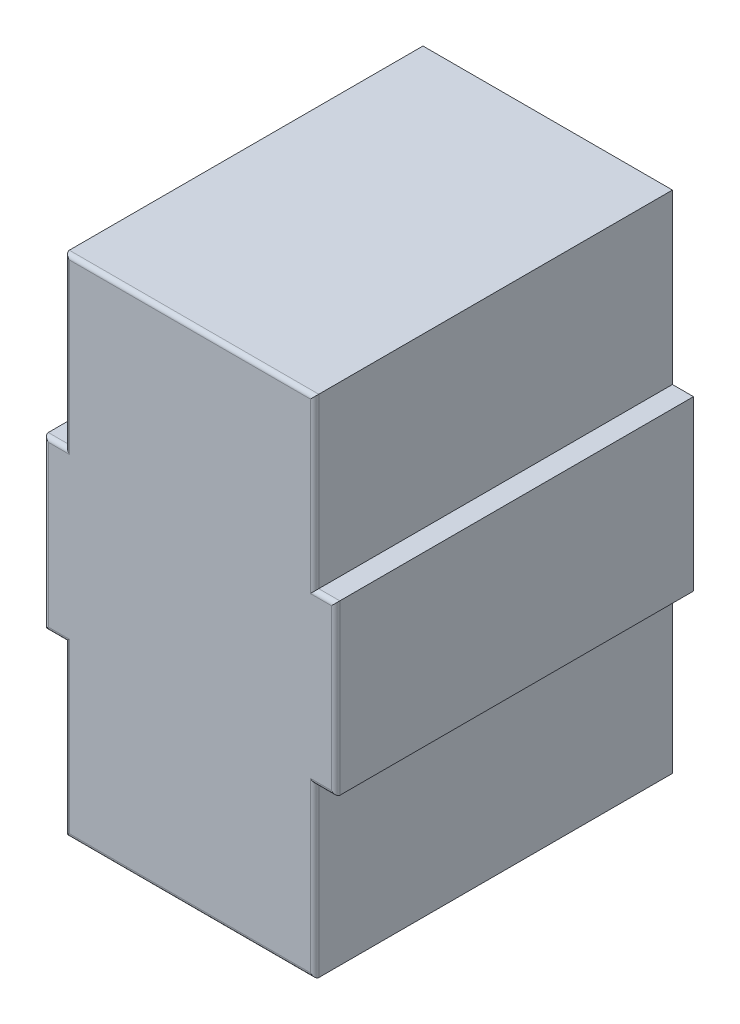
ISO-10303-21;
HEADER;
FILE_DESCRIPTION(('STEP AP214'),'2;1');
FILE_NAME('part.step','',(''),(''),'','','');
FILE_SCHEMA(('AUTOMOTIVE_DESIGN { 1 0 10303 214 1 1 1 1 }'));
ENDSEC;
DATA;
#1=APPLICATION_CONTEXT('core data for automotive mechanical design processes');
#2=APPLICATION_PROTOCOL_DEFINITION('international standard','automotive_design',2000,#1);
#3=PRODUCT_CONTEXT('',#1,'mechanical');
#4=PRODUCT('Part','Part','',(#3));
#5=PRODUCT_RELATED_PRODUCT_CATEGORY('part','',(#4));
#6=PRODUCT_DEFINITION_FORMATION('','',#4);
#7=PRODUCT_DEFINITION_CONTEXT('part definition',#1,'design');
#8=PRODUCT_DEFINITION('design','',#6,#7);
#9=PRODUCT_DEFINITION_SHAPE('','',#8);
#10=(LENGTH_UNIT() NAMED_UNIT(*) SI_UNIT(.MILLI.,.METRE.));
#11=(NAMED_UNIT(*) PLANE_ANGLE_UNIT() SI_UNIT($,.RADIAN.));
#12=(NAMED_UNIT(*) SI_UNIT($,.STERADIAN.) SOLID_ANGLE_UNIT());
#13=UNCERTAINTY_MEASURE_WITH_UNIT(LENGTH_MEASURE(1.E-05),#10,'distance_accuracy_value','');
#14=(GEOMETRIC_REPRESENTATION_CONTEXT(3) GLOBAL_UNCERTAINTY_ASSIGNED_CONTEXT((#13)) GLOBAL_UNIT_ASSIGNED_CONTEXT((#10,
#11,#12)) REPRESENTATION_CONTEXT('',''));
#15=CARTESIAN_POINT('',(0.,0.,0.));
#16=DIRECTION('',(0.,0.,1.));
#17=DIRECTION('',(1.,0.,0.));
#18=AXIS2_PLACEMENT_3D('',#15,#16,#17);
#19=CARTESIAN_POINT('',(1.,0.,17.));
#20=DIRECTION('',(0.,1.,0.));
#21=DIRECTION('',(0.,0.,1.));
#22=AXIS2_PLACEMENT_3D('',#19,#20,#21);
#23=PLANE('',#22);
#24=DIRECTION('',(0.,0.,-1.));
#25=VECTOR('',#24,1.);
#26=CARTESIAN_POINT('',(12.85,0.,17.));
#27=LINE('',#26,#25);
#28=CARTESIAN_POINT('',(12.85,0.,16.8));
#29=VERTEX_POINT('',#28);
#30=CARTESIAN_POINT('',(12.85,0.,0.));
#31=VERTEX_POINT('',#30);
#32=EDGE_CURVE('E153',#29,#31,#27,.T.);
#33=ORIENTED_EDGE('',*,*,#32,.F.);
#34=DIRECTION('',(1.,0.,0.));
#35=VECTOR('',#34,1.);
#36=CARTESIAN_POINT('',(1.,0.,16.8));
#37=LINE('',#36,#35);
#38=CARTESIAN_POINT('',(1.,0.,16.8));
#39=VERTEX_POINT('',#38);
#40=EDGE_CURVE('E11',#29,#39,#37,.F.);
#41=ORIENTED_EDGE('',*,*,#40,.T.);
#42=DIRECTION('',(0.,0.,-1.));
#43=VECTOR('',#42,1.);
#44=CARTESIAN_POINT('',(1.,0.,17.));
#45=LINE('',#44,#43);
#46=CARTESIAN_POINT('',(1.,0.,0.));
#47=VERTEX_POINT('',#46);
#48=EDGE_CURVE('E174',#39,#47,#45,.T.);
#49=ORIENTED_EDGE('',*,*,#48,.T.);
#50=DIRECTION('',(1.,0.,0.));
#51=VECTOR('',#50,1.);
#52=CARTESIAN_POINT('',(1.,0.,0.));
#53=LINE('',#52,#51);
#54=EDGE_CURVE('E168',#47,#31,#53,.T.);
#55=ORIENTED_EDGE('',*,*,#54,.T.);
#56=EDGE_LOOP('',(#33,#41,#49,#55));
#57=FACE_BOUND('',#56,.T.);
#58=ADVANCED_FACE('F32',(#57),#23,.F.);
#59=CARTESIAN_POINT('',(12.85,0.,17.));
#60=DIRECTION('',(-1.,0.,0.));
#61=DIRECTION('',(0.,0.,1.));
#62=AXIS2_PLACEMENT_3D('',#59,#60,#61);
#63=PLANE('',#62);
#64=DIRECTION('',(0.,0.,-1.));
#65=VECTOR('',#64,1.);
#66=CARTESIAN_POINT('',(12.85,8.,17.));
#67=LINE('',#66,#65);
#68=CARTESIAN_POINT('',(12.85,8.,16.8));
#69=VERTEX_POINT('',#68);
#70=CARTESIAN_POINT('',(12.85,8.,0.));
#71=VERTEX_POINT('',#70);
#72=EDGE_CURVE('E162',#69,#71,#67,.T.);
#73=ORIENTED_EDGE('',*,*,#72,.F.);
#74=DIRECTION('',(0.,1.,0.));
#75=VECTOR('',#74,1.);
#76=CARTESIAN_POINT('',(12.85,0.,16.8));
#77=LINE('',#76,#75);
#78=EDGE_CURVE('E39',#69,#29,#77,.F.);
#79=ORIENTED_EDGE('',*,*,#78,.T.);
#80=ORIENTED_EDGE('',*,*,#32,.T.);
#81=DIRECTION('',(0.,1.,0.));
#82=VECTOR('',#81,1.);
#83=CARTESIAN_POINT('',(12.85,0.,0.));
#84=LINE('',#83,#82);
#85=EDGE_CURVE('E156',#31,#71,#84,.T.);
#86=ORIENTED_EDGE('',*,*,#85,.T.);
#87=EDGE_LOOP('',(#73,#79,#80,#86));
#88=FACE_BOUND('',#87,.T.);
#89=ADVANCED_FACE('F155',(#88),#63,.F.);
#90=CARTESIAN_POINT('',(13.85,8.,17.));
#91=DIRECTION('',(0.,1.,0.));
#92=DIRECTION('',(0.,0.,1.));
#93=AXIS2_PLACEMENT_3D('',#90,#91,#92);
#94=PLANE('',#93);
#95=DIRECTION('',(0.,0.,-1.));
#96=VECTOR('',#95,1.);
#97=CARTESIAN_POINT('',(13.85,8.,17.));
#98=LINE('',#97,#96);
#99=CARTESIAN_POINT('',(13.85,8.,16.8));
#100=VERTEX_POINT('',#99);
#101=CARTESIAN_POINT('',(13.85,8.,0.));
#102=VERTEX_POINT('',#101);
#103=EDGE_CURVE('E227',#100,#102,#98,.T.);
#104=ORIENTED_EDGE('',*,*,#103,.F.);
#105=DIRECTION('',(1.,0.,0.));
#106=VECTOR('',#105,1.);
#107=CARTESIAN_POINT('',(12.85,8.,16.8));
#108=LINE('',#107,#106);
#109=EDGE_CURVE('E53',#100,#69,#108,.F.);
#110=ORIENTED_EDGE('',*,*,#109,.T.);
#111=ORIENTED_EDGE('',*,*,#72,.T.);
#112=DIRECTION('',(1.,0.,0.));
#113=VECTOR('',#112,1.);
#114=CARTESIAN_POINT('',(13.85,8.,0.));
#115=LINE('',#114,#113);
#116=EDGE_CURVE('E171',#71,#102,#115,.T.);
#117=ORIENTED_EDGE('',*,*,#116,.T.);
#118=EDGE_LOOP('',(#104,#110,#111,#117));
#119=FACE_BOUND('',#118,.T.);
#120=ADVANCED_FACE('F281',(#119),#94,.F.);
#121=CARTESIAN_POINT('',(13.85,8.,17.));
#122=DIRECTION('',(-1.,0.,0.));
#123=DIRECTION('',(0.,0.,1.));
#124=AXIS2_PLACEMENT_3D('',#121,#122,#123);
#125=PLANE('',#124);
#126=DIRECTION('',(0.,0.,-1.));
#127=VECTOR('',#126,1.);
#128=CARTESIAN_POINT('',(13.85,16.,17.));
#129=LINE('',#128,#127);
#130=CARTESIAN_POINT('',(13.85,16.,16.8));
#131=VERTEX_POINT('',#130);
#132=CARTESIAN_POINT('',(13.85,16.,0.));
#133=VERTEX_POINT('',#132);
#134=EDGE_CURVE('E225',#131,#133,#129,.T.);
#135=ORIENTED_EDGE('',*,*,#134,.F.);
#136=DIRECTION('',(0.,1.,0.));
#137=VECTOR('',#136,1.);
#138=CARTESIAN_POINT('',(13.85,8.,16.8));
#139=LINE('',#138,#137);
#140=EDGE_CURVE('E271',#131,#100,#139,.F.);
#141=ORIENTED_EDGE('',*,*,#140,.T.);
#142=ORIENTED_EDGE('',*,*,#103,.T.);
#143=DIRECTION('',(0.,1.,0.));
#144=VECTOR('',#143,1.);
#145=CARTESIAN_POINT('',(13.85,8.,0.));
#146=LINE('',#145,#144);
#147=EDGE_CURVE('E184',#102,#133,#146,.T.);
#148=ORIENTED_EDGE('',*,*,#147,.T.);
#149=EDGE_LOOP('',(#135,#141,#142,#148));
#150=FACE_BOUND('',#149,.T.);
#151=ADVANCED_FACE('F276',(#150),#125,.F.);
#152=CARTESIAN_POINT('',(13.85,16.,17.));
#153=DIRECTION('',(0.,-1.,0.));
#154=DIRECTION('',(0.,0.,-1.));
#155=AXIS2_PLACEMENT_3D('',#152,#153,#154);
#156=PLANE('',#155);
#157=DIRECTION('',(0.,0.,-1.));
#158=VECTOR('',#157,1.);
#159=CARTESIAN_POINT('',(12.85,16.,17.));
#160=LINE('',#159,#158);
#161=CARTESIAN_POINT('',(12.85,16.,16.8));
#162=VERTEX_POINT('',#161);
#163=CARTESIAN_POINT('',(12.85,16.,0.));
#164=VERTEX_POINT('',#163);
#165=EDGE_CURVE('E223',#162,#164,#160,.T.);
#166=ORIENTED_EDGE('',*,*,#165,.F.);
#167=DIRECTION('',(-1.,0.,0.));
#168=VECTOR('',#167,1.);
#169=CARTESIAN_POINT('',(13.85,16.,16.8));
#170=LINE('',#169,#168);
#171=EDGE_CURVE('E269',#162,#131,#170,.F.);
#172=ORIENTED_EDGE('',*,*,#171,.T.);
#173=ORIENTED_EDGE('',*,*,#134,.T.);
#174=DIRECTION('',(-1.,0.,0.));
#175=VECTOR('',#174,1.);
#176=CARTESIAN_POINT('',(13.85,16.,0.));
#177=LINE('',#176,#175);
#178=EDGE_CURVE('E187',#133,#164,#177,.T.);
#179=ORIENTED_EDGE('',*,*,#178,.T.);
#180=EDGE_LOOP('',(#166,#172,#173,#179));
#181=FACE_BOUND('',#180,.T.);
#182=ADVANCED_FACE('F403',(#181),#156,.F.);
#183=CARTESIAN_POINT('',(12.85,16.,17.));
#184=DIRECTION('',(-1.,0.,0.));
#185=DIRECTION('',(0.,0.,1.));
#186=AXIS2_PLACEMENT_3D('',#183,#184,#185);
#187=PLANE('',#186);
#188=DIRECTION('',(0.,0.,-1.));
#189=VECTOR('',#188,1.);
#190=CARTESIAN_POINT('',(12.85,24.,17.));
#191=LINE('',#190,#189);
#192=CARTESIAN_POINT('',(12.85,24.,16.8));
#193=VERTEX_POINT('',#192);
#194=CARTESIAN_POINT('',(12.85,24.,0.));
#195=VERTEX_POINT('',#194);
#196=EDGE_CURVE('E221',#193,#195,#191,.T.);
#197=ORIENTED_EDGE('',*,*,#196,.F.);
#198=DIRECTION('',(0.,1.,0.));
#199=VECTOR('',#198,1.);
#200=CARTESIAN_POINT('',(12.85,16.,16.8));
#201=LINE('',#200,#199);
#202=EDGE_CURVE('E267',#193,#162,#201,.F.);
#203=ORIENTED_EDGE('',*,*,#202,.T.);
#204=ORIENTED_EDGE('',*,*,#165,.T.);
#205=DIRECTION('',(0.,1.,0.));
#206=VECTOR('',#205,1.);
#207=CARTESIAN_POINT('',(12.85,16.,0.));
#208=LINE('',#207,#206);
#209=EDGE_CURVE('E190',#164,#195,#208,.T.);
#210=ORIENTED_EDGE('',*,*,#209,.T.);
#211=EDGE_LOOP('',(#197,#203,#204,#210));
#212=FACE_BOUND('',#211,.T.);
#213=ADVANCED_FACE('F406',(#212),#187,.F.);
#214=CARTESIAN_POINT('',(1.,24.,17.));
#215=DIRECTION('',(0.,-1.,0.));
#216=DIRECTION('',(0.,0.,-1.));
#217=AXIS2_PLACEMENT_3D('',#214,#215,#216);
#218=PLANE('',#217);
#219=DIRECTION('',(0.,0.,-1.));
#220=VECTOR('',#219,1.);
#221=CARTESIAN_POINT('',(1.,24.,17.));
#222=LINE('',#221,#220);
#223=CARTESIAN_POINT('',(1.,24.,16.8));
#224=VERTEX_POINT('',#223);
#225=CARTESIAN_POINT('',(1.,24.,0.));
#226=VERTEX_POINT('',#225);
#227=EDGE_CURVE('E219',#224,#226,#222,.T.);
#228=ORIENTED_EDGE('',*,*,#227,.F.);
#229=DIRECTION('',(-1.,0.,0.));
#230=VECTOR('',#229,1.);
#231=CARTESIAN_POINT('',(12.85,24.,16.8));
#232=LINE('',#231,#230);
#233=EDGE_CURVE('E265',#224,#193,#232,.F.);
#234=ORIENTED_EDGE('',*,*,#233,.T.);
#235=ORIENTED_EDGE('',*,*,#196,.T.);
#236=DIRECTION('',(-1.,0.,0.));
#237=VECTOR('',#236,1.);
#238=CARTESIAN_POINT('',(1.,24.,0.));
#239=LINE('',#238,#237);
#240=EDGE_CURVE('E193',#195,#226,#239,.T.);
#241=ORIENTED_EDGE('',*,*,#240,.T.);
#242=EDGE_LOOP('',(#228,#234,#235,#241));
#243=FACE_BOUND('',#242,.T.);
#244=ADVANCED_FACE('F378',(#243),#218,.F.);
#245=CARTESIAN_POINT('',(1.,16.,17.));
#246=DIRECTION('',(1.,0.,0.));
#247=DIRECTION('',(0.,1.,0.));
#248=AXIS2_PLACEMENT_3D('',#245,#246,#247);
#249=PLANE('',#248);
#250=DIRECTION('',(0.,0.,-1.));
#251=VECTOR('',#250,1.);
#252=CARTESIAN_POINT('',(1.,16.,17.));
#253=LINE('',#252,#251);
#254=CARTESIAN_POINT('',(1.,16.,16.8));
#255=VERTEX_POINT('',#254);
#256=CARTESIAN_POINT('',(1.,16.,0.));
#257=VERTEX_POINT('',#256);
#258=EDGE_CURVE('E217',#255,#257,#253,.T.);
#259=ORIENTED_EDGE('',*,*,#258,.F.);
#260=DIRECTION('',(0.,-1.,0.));
#261=VECTOR('',#260,1.);
#262=CARTESIAN_POINT('',(1.,24.,16.8));
#263=LINE('',#262,#261);
#264=EDGE_CURVE('E263',#255,#224,#263,.F.);
#265=ORIENTED_EDGE('',*,*,#264,.T.);
#266=ORIENTED_EDGE('',*,*,#227,.T.);
#267=DIRECTION('',(0.,-1.,0.));
#268=VECTOR('',#267,1.);
#269=CARTESIAN_POINT('',(1.,16.,0.));
#270=LINE('',#269,#268);
#271=EDGE_CURVE('E196',#226,#257,#270,.T.);
#272=ORIENTED_EDGE('',*,*,#271,.T.);
#273=EDGE_LOOP('',(#259,#265,#266,#272));
#274=FACE_BOUND('',#273,.T.);
#275=ADVANCED_FACE('F375',(#274),#249,.F.);
#276=CARTESIAN_POINT('',(1.,16.,17.));
#277=DIRECTION('',(0.,-1.,0.));
#278=DIRECTION('',(0.,0.,-1.));
#279=AXIS2_PLACEMENT_3D('',#276,#277,#278);
#280=PLANE('',#279);
#281=DIRECTION('',(0.,0.,-1.));
#282=VECTOR('',#281,1.);
#283=CARTESIAN_POINT('',(0.,16.,17.));
#284=LINE('',#283,#282);
#285=CARTESIAN_POINT('',(0.,16.,16.8));
#286=VERTEX_POINT('',#285);
#287=CARTESIAN_POINT('',(0.,16.,0.));
#288=VERTEX_POINT('',#287);
#289=EDGE_CURVE('E215',#286,#288,#284,.T.);
#290=ORIENTED_EDGE('',*,*,#289,.F.);
#291=DIRECTION('',(-1.,0.,0.));
#292=VECTOR('',#291,1.);
#293=CARTESIAN_POINT('',(0.999999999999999,16.,16.8));
#294=LINE('',#293,#292);
#295=EDGE_CURVE('E261',#286,#255,#294,.F.);
#296=ORIENTED_EDGE('',*,*,#295,.T.);
#297=ORIENTED_EDGE('',*,*,#258,.T.);
#298=DIRECTION('',(-1.,0.,0.));
#299=VECTOR('',#298,1.);
#300=CARTESIAN_POINT('',(1.,16.,0.));
#301=LINE('',#300,#299);
#302=EDGE_CURVE('E199',#257,#288,#301,.T.);
#303=ORIENTED_EDGE('',*,*,#302,.T.);
#304=EDGE_LOOP('',(#290,#296,#297,#303));
#305=FACE_BOUND('',#304,.T.);
#306=ADVANCED_FACE('F415',(#305),#280,.F.);
#307=CARTESIAN_POINT('',(0.,8.,17.));
#308=DIRECTION('',(1.,0.,0.));
#309=DIRECTION('',(0.,0.,-1.));
#310=AXIS2_PLACEMENT_3D('',#307,#308,#309);
#311=PLANE('',#310);
#312=DIRECTION('',(0.,0.,-1.));
#313=VECTOR('',#312,1.);
#314=CARTESIAN_POINT('',(0.,8.,17.));
#315=LINE('',#314,#313);
#316=CARTESIAN_POINT('',(0.,8.,16.8));
#317=VERTEX_POINT('',#316);
#318=CARTESIAN_POINT('',(0.,8.,0.));
#319=VERTEX_POINT('',#318);
#320=EDGE_CURVE('E213',#317,#319,#315,.T.);
#321=ORIENTED_EDGE('',*,*,#320,.F.);
#322=DIRECTION('',(0.,-1.,0.));
#323=VECTOR('',#322,1.);
#324=CARTESIAN_POINT('',(0.,16.,16.8));
#325=LINE('',#324,#323);
#326=EDGE_CURVE('E259',#317,#286,#325,.F.);
#327=ORIENTED_EDGE('',*,*,#326,.T.);
#328=ORIENTED_EDGE('',*,*,#289,.T.);
#329=DIRECTION('',(0.,-1.,0.));
#330=VECTOR('',#329,1.);
#331=CARTESIAN_POINT('',(0.,8.,0.));
#332=LINE('',#331,#330);
#333=EDGE_CURVE('E202',#288,#319,#332,.T.);
#334=ORIENTED_EDGE('',*,*,#333,.T.);
#335=EDGE_LOOP('',(#321,#327,#328,#334));
#336=FACE_BOUND('',#335,.T.);
#337=ADVANCED_FACE('F330',(#336),#311,.F.);
#338=CARTESIAN_POINT('',(1.,8.,17.));
#339=DIRECTION('',(0.,1.,0.));
#340=DIRECTION('',(0.,0.,1.));
#341=AXIS2_PLACEMENT_3D('',#338,#339,#340);
#342=PLANE('',#341);
#343=DIRECTION('',(0.,0.,-1.));
#344=VECTOR('',#343,1.);
#345=CARTESIAN_POINT('',(1.,8.,17.));
#346=LINE('',#345,#344);
#347=CARTESIAN_POINT('',(1.,8.,16.8));
#348=VERTEX_POINT('',#347);
#349=CARTESIAN_POINT('',(1.,8.,0.));
#350=VERTEX_POINT('',#349);
#351=EDGE_CURVE('E211',#348,#350,#346,.T.);
#352=ORIENTED_EDGE('',*,*,#351,.F.);
#353=DIRECTION('',(1.,0.,0.));
#354=VECTOR('',#353,1.);
#355=CARTESIAN_POINT('',(0.,8.,16.8));
#356=LINE('',#355,#354);
#357=EDGE_CURVE('E257',#348,#317,#356,.F.);
#358=ORIENTED_EDGE('',*,*,#357,.T.);
#359=ORIENTED_EDGE('',*,*,#320,.T.);
#360=DIRECTION('',(1.,0.,0.));
#361=VECTOR('',#360,1.);
#362=CARTESIAN_POINT('',(1.,8.,0.));
#363=LINE('',#362,#361);
#364=EDGE_CURVE('E205',#319,#350,#363,.T.);
#365=ORIENTED_EDGE('',*,*,#364,.T.);
#366=EDGE_LOOP('',(#352,#358,#359,#365));
#367=FACE_BOUND('',#366,.T.);
#368=ADVANCED_FACE('F327',(#367),#342,.F.);
#369=CARTESIAN_POINT('',(1.,0.,17.));
#370=DIRECTION('',(1.,0.,0.));
#371=DIRECTION('',(0.,1.,0.));
#372=AXIS2_PLACEMENT_3D('',#369,#370,#371);
#373=PLANE('',#372);
#374=ORIENTED_EDGE('',*,*,#48,.F.);
#375=DIRECTION('',(0.,-1.,0.));
#376=VECTOR('',#375,1.);
#377=CARTESIAN_POINT('',(1.,8.,16.8));
#378=LINE('',#377,#376);
#379=EDGE_CURVE('E254',#39,#348,#378,.F.);
#380=ORIENTED_EDGE('',*,*,#379,.T.);
#381=ORIENTED_EDGE('',*,*,#351,.T.);
#382=DIRECTION('',(0.,-1.,0.));
#383=VECTOR('',#382,1.);
#384=CARTESIAN_POINT('',(1.,0.,0.));
#385=LINE('',#384,#383);
#386=EDGE_CURVE('E208',#350,#47,#385,.T.);
#387=ORIENTED_EDGE('',*,*,#386,.T.);
#388=EDGE_LOOP('',(#374,#380,#381,#387));
#389=FACE_BOUND('',#388,.T.);
#390=ADVANCED_FACE('F312',(#389),#373,.F.);
#391=CARTESIAN_POINT('',(12.85,0.,17.));
#392=DIRECTION('',(0.,0.,1.));
#393=DIRECTION('',(1.,0.,0.));
#394=AXIS2_PLACEMENT_3D('',#391,#392,#393);
#395=PLANE('',#394);
#396=DIRECTION('',(1.,0.,0.));
#397=VECTOR('',#396,1.);
#398=CARTESIAN_POINT('',(0.999999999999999,8.2,17.));
#399=LINE('',#398,#397);
#400=CARTESIAN_POINT('',(0.200000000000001,8.2,17.));
#401=VERTEX_POINT('',#400);
#402=CARTESIAN_POINT('',(1.2,8.2,17.));
#403=VERTEX_POINT('',#402);
#404=EDGE_CURVE('E249',#401,#403,#399,.T.);
#405=ORIENTED_EDGE('',*,*,#404,.T.);
#406=DIRECTION('',(0.,-1.,0.));
#407=VECTOR('',#406,1.);
#408=CARTESIAN_POINT('',(1.2,0.,17.));
#409=LINE('',#408,#407);
#410=CARTESIAN_POINT('',(1.2,0.2,17.));
#411=VERTEX_POINT('',#410);
#412=EDGE_CURVE('E251',#403,#411,#409,.T.);
#413=ORIENTED_EDGE('',*,*,#412,.T.);
#414=DIRECTION('',(1.,0.,0.));
#415=VECTOR('',#414,1.);
#416=CARTESIAN_POINT('',(12.85,0.2,17.));
#417=LINE('',#416,#415);
#418=CARTESIAN_POINT('',(12.65,0.2,17.));
#419=VERTEX_POINT('',#418);
#420=EDGE_CURVE('E161',#411,#419,#417,.T.);
#421=ORIENTED_EDGE('',*,*,#420,.T.);
#422=DIRECTION('',(0.,1.,0.));
#423=VECTOR('',#422,1.);
#424=CARTESIAN_POINT('',(12.65,8.,17.));
#425=LINE('',#424,#423);
#426=CARTESIAN_POINT('',(12.65,8.2,17.));
#427=VERTEX_POINT('',#426);
#428=EDGE_CURVE('E231',#419,#427,#425,.T.);
#429=ORIENTED_EDGE('',*,*,#428,.T.);
#430=DIRECTION('',(1.,0.,0.));
#431=VECTOR('',#430,1.);
#432=CARTESIAN_POINT('',(13.85,8.2,17.));
#433=LINE('',#432,#431);
#434=CARTESIAN_POINT('',(13.65,8.2,17.));
#435=VERTEX_POINT('',#434);
#436=EDGE_CURVE('E233',#427,#435,#433,.T.);
#437=ORIENTED_EDGE('',*,*,#436,.T.);
#438=DIRECTION('',(0.,1.,0.));
#439=VECTOR('',#438,1.);
#440=CARTESIAN_POINT('',(13.65,16.,17.));
#441=LINE('',#440,#439);
#442=CARTESIAN_POINT('',(13.65,15.8,17.));
#443=VERTEX_POINT('',#442);
#444=EDGE_CURVE('E235',#435,#443,#441,.T.);
#445=ORIENTED_EDGE('',*,*,#444,.T.);
#446=DIRECTION('',(-1.,0.,0.));
#447=VECTOR('',#446,1.);
#448=CARTESIAN_POINT('',(12.85,15.8,17.));
#449=LINE('',#448,#447);
#450=CARTESIAN_POINT('',(12.65,15.8,17.));
#451=VERTEX_POINT('',#450);
#452=EDGE_CURVE('E237',#443,#451,#449,.T.);
#453=ORIENTED_EDGE('',*,*,#452,.T.);
#454=DIRECTION('',(0.,1.,0.));
#455=VECTOR('',#454,1.);
#456=CARTESIAN_POINT('',(12.65,24.,17.));
#457=LINE('',#456,#455);
#458=CARTESIAN_POINT('',(12.65,23.8,17.));
#459=VERTEX_POINT('',#458);
#460=EDGE_CURVE('E239',#451,#459,#457,.T.);
#461=ORIENTED_EDGE('',*,*,#460,.T.);
#462=DIRECTION('',(-1.,0.,0.));
#463=VECTOR('',#462,1.);
#464=CARTESIAN_POINT('',(1.,23.8,17.));
#465=LINE('',#464,#463);
#466=CARTESIAN_POINT('',(1.2,23.8,17.));
#467=VERTEX_POINT('',#466);
#468=EDGE_CURVE('E241',#459,#467,#465,.T.);
#469=ORIENTED_EDGE('',*,*,#468,.T.);
#470=DIRECTION('',(0.,-1.,0.));
#471=VECTOR('',#470,1.);
#472=CARTESIAN_POINT('',(1.2,16.,17.));
#473=LINE('',#472,#471);
#474=CARTESIAN_POINT('',(1.2,15.8,17.));
#475=VERTEX_POINT('',#474);
#476=EDGE_CURVE('E243',#467,#475,#473,.T.);
#477=ORIENTED_EDGE('',*,*,#476,.T.);
#478=DIRECTION('',(-1.,0.,0.));
#479=VECTOR('',#478,1.);
#480=CARTESIAN_POINT('',(0.,15.8,17.));
#481=LINE('',#480,#479);
#482=CARTESIAN_POINT('',(0.200000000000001,15.8,17.));
#483=VERTEX_POINT('',#482);
#484=EDGE_CURVE('E245',#475,#483,#481,.T.);
#485=ORIENTED_EDGE('',*,*,#484,.T.);
#486=DIRECTION('',(0.,-1.,0.));
#487=VECTOR('',#486,1.);
#488=CARTESIAN_POINT('',(0.200000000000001,8.,17.));
#489=LINE('',#488,#487);
#490=EDGE_CURVE('E247',#483,#401,#489,.T.);
#491=ORIENTED_EDGE('',*,*,#490,.T.);
#492=EDGE_LOOP('',(#405,#413,#421,#429,#437,#445,#453,#461,#469,#477,#485,#491));
#493=FACE_BOUND('',#492,.T.);
#494=ADVANCED_FACE('F364',(#493),#395,.T.);
#495=CARTESIAN_POINT('',(12.85,0.,0.));
#496=DIRECTION('',(0.,0.,1.));
#497=DIRECTION('',(1.,0.,0.));
#498=AXIS2_PLACEMENT_3D('',#495,#496,#497);
#499=PLANE('',#498);
#500=ORIENTED_EDGE('',*,*,#54,.F.);
#501=ORIENTED_EDGE('',*,*,#386,.F.);
#502=ORIENTED_EDGE('',*,*,#364,.F.);
#503=ORIENTED_EDGE('',*,*,#333,.F.);
#504=ORIENTED_EDGE('',*,*,#302,.F.);
#505=ORIENTED_EDGE('',*,*,#271,.F.);
#506=ORIENTED_EDGE('',*,*,#240,.F.);
#507=ORIENTED_EDGE('',*,*,#209,.F.);
#508=ORIENTED_EDGE('',*,*,#178,.F.);
#509=ORIENTED_EDGE('',*,*,#147,.F.);
#510=ORIENTED_EDGE('',*,*,#116,.F.);
#511=ORIENTED_EDGE('',*,*,#85,.F.);
#512=EDGE_LOOP('',(#500,#501,#502,#503,#504,#505,#506,#507,#508,#509,#510,#511));
#513=FACE_BOUND('',#512,.T.);
#514=ADVANCED_FACE('F166',(#513),#499,.F.);
#515=CARTESIAN_POINT('',(12.65,0.,16.8));
#516=DIRECTION('',(0.,-1.,0.));
#517=DIRECTION('',(0.,0.,-1.));
#518=AXIS2_PLACEMENT_3D('',#515,#516,#517);
#519=CYLINDRICAL_SURFACE('',#518,0.2);
#520=CARTESIAN_POINT('',(12.65,15.8,16.8));
#521=DIRECTION('',(0.707106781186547,-0.707106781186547,0.));
#522=DIRECTION('',(-0.707106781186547,-0.707106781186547,0.));
#523=AXIS2_PLACEMENT_3D('',#520,#521,#522);
#524=ELLIPSE('',#523,0.282842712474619,0.2);
#525=EDGE_CURVE('E179',#162,#451,#524,.T.);
#526=ORIENTED_EDGE('',*,*,#525,.F.);
#527=ORIENTED_EDGE('',*,*,#202,.F.);
#528=CARTESIAN_POINT('',(12.65,23.8,16.8));
#529=DIRECTION('',(0.707106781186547,-0.707106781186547,0.));
#530=DIRECTION('',(-0.707106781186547,-0.707106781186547,0.));
#531=AXIS2_PLACEMENT_3D('',#528,#529,#530);
#532=ELLIPSE('',#531,0.282842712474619,0.2);
#533=EDGE_CURVE('E176',#459,#193,#532,.F.);
#534=ORIENTED_EDGE('',*,*,#533,.F.);
#535=ORIENTED_EDGE('',*,*,#460,.F.);
#536=EDGE_LOOP('',(#526,#527,#534,#535));
#537=FACE_BOUND('',#536,.T.);
#538=ADVANCED_FACE('F360',(#537),#519,.T.);
#539=CARTESIAN_POINT('',(12.85,23.8,16.8));
#540=DIRECTION('',(1.,0.,0.));
#541=DIRECTION('',(0.,0.,-1.));
#542=AXIS2_PLACEMENT_3D('',#539,#540,#541);
#543=CYLINDRICAL_SURFACE('',#542,0.2);
#544=ORIENTED_EDGE('',*,*,#533,.T.);
#545=ORIENTED_EDGE('',*,*,#233,.F.);
#546=CARTESIAN_POINT('',(1.2,23.8,16.8));
#547=DIRECTION('',(0.707106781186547,0.707106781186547,0.));
#548=DIRECTION('',(0.707106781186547,-0.707106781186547,0.));
#549=AXIS2_PLACEMENT_3D('',#546,#547,#548);
#550=ELLIPSE('',#549,0.282842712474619,0.2);
#551=EDGE_CURVE('E349',#467,#224,#550,.F.);
#552=ORIENTED_EDGE('',*,*,#551,.F.);
#553=ORIENTED_EDGE('',*,*,#468,.F.);
#554=EDGE_LOOP('',(#544,#545,#552,#553));
#555=FACE_BOUND('',#554,.T.);
#556=ADVANCED_FACE('F383',(#555),#543,.T.);
#557=CARTESIAN_POINT('',(12.85,15.8,16.8));
#558=DIRECTION('',(1.,0.,0.));
#559=DIRECTION('',(0.,0.,-1.));
#560=AXIS2_PLACEMENT_3D('',#557,#558,#559);
#561=CYLINDRICAL_SURFACE('',#560,0.2);
#562=ORIENTED_EDGE('',*,*,#525,.T.);
#563=ORIENTED_EDGE('',*,*,#452,.F.);
#564=CARTESIAN_POINT('',(13.65,15.8,16.8));
#565=DIRECTION('',(0.707106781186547,-0.707106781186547,0.));
#566=DIRECTION('',(-0.707106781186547,-0.707106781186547,0.));
#567=AXIS2_PLACEMENT_3D('',#564,#565,#566);
#568=ELLIPSE('',#567,0.282842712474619,0.2);
#569=EDGE_CURVE('E347',#131,#443,#568,.T.);
#570=ORIENTED_EDGE('',*,*,#569,.F.);
#571=ORIENTED_EDGE('',*,*,#171,.F.);
#572=EDGE_LOOP('',(#562,#563,#570,#571));
#573=FACE_BOUND('',#572,.T.);
#574=ADVANCED_FACE('F356',(#573),#561,.T.);
#575=CARTESIAN_POINT('',(1.2,0.,16.8));
#576=DIRECTION('',(0.,1.,0.));
#577=DIRECTION('',(-1.,0.,0.));
#578=AXIS2_PLACEMENT_3D('',#575,#576,#577);
#579=CYLINDRICAL_SURFACE('',#578,0.2);
#580=ORIENTED_EDGE('',*,*,#551,.T.);
#581=ORIENTED_EDGE('',*,*,#264,.F.);
#582=CARTESIAN_POINT('',(1.2,15.8,16.8));
#583=DIRECTION('',(0.707106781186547,0.707106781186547,0.));
#584=DIRECTION('',(0.707106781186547,-0.707106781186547,0.));
#585=AXIS2_PLACEMENT_3D('',#582,#583,#584);
#586=ELLIPSE('',#585,0.282842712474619,0.2);
#587=EDGE_CURVE('E288',#475,#255,#586,.F.);
#588=ORIENTED_EDGE('',*,*,#587,.F.);
#589=ORIENTED_EDGE('',*,*,#476,.F.);
#590=EDGE_LOOP('',(#580,#581,#588,#589));
#591=FACE_BOUND('',#590,.T.);
#592=ADVANCED_FACE('F371',(#591),#579,.T.);
#593=CARTESIAN_POINT('',(13.65,0.,16.8));
#594=DIRECTION('',(0.,-1.,0.));
#595=DIRECTION('',(0.,0.,-1.));
#596=AXIS2_PLACEMENT_3D('',#593,#594,#595);
#597=CYLINDRICAL_SURFACE('',#596,0.2);
#598=ORIENTED_EDGE('',*,*,#569,.T.);
#599=ORIENTED_EDGE('',*,*,#444,.F.);
#600=CARTESIAN_POINT('',(13.65,8.2,16.8));
#601=DIRECTION('',(-0.707106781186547,-0.707106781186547,0.));
#602=DIRECTION('',(-0.707106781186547,0.707106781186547,0.));
#603=AXIS2_PLACEMENT_3D('',#600,#601,#602);
#604=ELLIPSE('',#603,0.282842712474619,0.2);
#605=EDGE_CURVE('E284',#100,#435,#604,.T.);
#606=ORIENTED_EDGE('',*,*,#605,.F.);
#607=ORIENTED_EDGE('',*,*,#140,.F.);
#608=EDGE_LOOP('',(#598,#599,#606,#607));
#609=FACE_BOUND('',#608,.T.);
#610=ADVANCED_FACE('F285',(#609),#597,.T.);
#611=CARTESIAN_POINT('',(12.85,15.8,16.8));
#612=DIRECTION('',(1.,0.,0.));
#613=DIRECTION('',(0.,0.,-1.));
#614=AXIS2_PLACEMENT_3D('',#611,#612,#613);
#615=CYLINDRICAL_SURFACE('',#614,0.2);
#616=ORIENTED_EDGE('',*,*,#587,.T.);
#617=ORIENTED_EDGE('',*,*,#295,.F.);
#618=CARTESIAN_POINT('',(0.200000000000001,15.8,16.8));
#619=DIRECTION('',(0.707106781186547,0.707106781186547,0.));
#620=DIRECTION('',(0.707106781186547,-0.707106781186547,0.));
#621=AXIS2_PLACEMENT_3D('',#618,#619,#620);
#622=ELLIPSE('',#621,0.282842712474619,0.2);
#623=EDGE_CURVE('E289',#483,#286,#622,.F.);
#624=ORIENTED_EDGE('',*,*,#623,.F.);
#625=ORIENTED_EDGE('',*,*,#484,.F.);
#626=EDGE_LOOP('',(#616,#617,#624,#625));
#627=FACE_BOUND('',#626,.T.);
#628=ADVANCED_FACE('F368',(#627),#615,.T.);
#629=CARTESIAN_POINT('',(12.85,8.2,16.8));
#630=DIRECTION('',(-1.,0.,0.));
#631=DIRECTION('',(0.,0.,1.));
#632=AXIS2_PLACEMENT_3D('',#629,#630,#631);
#633=CYLINDRICAL_SURFACE('',#632,0.2);
#634=ORIENTED_EDGE('',*,*,#605,.T.);
#635=ORIENTED_EDGE('',*,*,#436,.F.);
#636=CARTESIAN_POINT('',(12.65,8.2,16.8));
#637=DIRECTION('',(-0.707106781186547,-0.707106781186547,0.));
#638=DIRECTION('',(-0.707106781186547,0.707106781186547,0.));
#639=AXIS2_PLACEMENT_3D('',#636,#637,#638);
#640=ELLIPSE('',#639,0.282842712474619,0.2);
#641=EDGE_CURVE('E294',#69,#427,#640,.T.);
#642=ORIENTED_EDGE('',*,*,#641,.F.);
#643=ORIENTED_EDGE('',*,*,#109,.F.);
#644=EDGE_LOOP('',(#634,#635,#642,#643));
#645=FACE_BOUND('',#644,.T.);
#646=ADVANCED_FACE('F292',(#645),#633,.T.);
#647=CARTESIAN_POINT('',(0.200000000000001,0.,16.8));
#648=DIRECTION('',(0.,1.,0.));
#649=DIRECTION('',(0.,0.,1.));
#650=AXIS2_PLACEMENT_3D('',#647,#648,#649);
#651=CYLINDRICAL_SURFACE('',#650,0.2);
#652=ORIENTED_EDGE('',*,*,#623,.T.);
#653=ORIENTED_EDGE('',*,*,#326,.F.);
#654=CARTESIAN_POINT('',(0.200000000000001,8.2,16.8));
#655=DIRECTION('',(-0.707106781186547,0.707106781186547,0.));
#656=DIRECTION('',(0.707106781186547,0.707106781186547,0.));
#657=AXIS2_PLACEMENT_3D('',#654,#655,#656);
#658=ELLIPSE('',#657,0.282842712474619,0.2);
#659=EDGE_CURVE('E297',#401,#317,#658,.F.);
#660=ORIENTED_EDGE('',*,*,#659,.F.);
#661=ORIENTED_EDGE('',*,*,#490,.F.);
#662=EDGE_LOOP('',(#652,#653,#660,#661));
#663=FACE_BOUND('',#662,.T.);
#664=ADVANCED_FACE('F336',(#663),#651,.T.);
#665=CARTESIAN_POINT('',(12.65,0.,16.8));
#666=DIRECTION('',(0.,-1.,0.));
#667=DIRECTION('',(0.,0.,-1.));
#668=AXIS2_PLACEMENT_3D('',#665,#666,#667);
#669=CYLINDRICAL_SURFACE('',#668,0.2);
#670=ORIENTED_EDGE('',*,*,#641,.T.);
#671=ORIENTED_EDGE('',*,*,#428,.F.);
#672=CARTESIAN_POINT('',(12.65,0.2,16.8));
#673=DIRECTION('',(-0.707106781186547,-0.707106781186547,0.));
#674=DIRECTION('',(-0.707106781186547,0.707106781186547,0.));
#675=AXIS2_PLACEMENT_3D('',#672,#673,#674);
#676=ELLIPSE('',#675,0.282842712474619,0.2);
#677=EDGE_CURVE('E301',#29,#419,#676,.T.);
#678=ORIENTED_EDGE('',*,*,#677,.F.);
#679=ORIENTED_EDGE('',*,*,#78,.F.);
#680=EDGE_LOOP('',(#670,#671,#678,#679));
#681=FACE_BOUND('',#680,.T.);
#682=ADVANCED_FACE('F299',(#681),#669,.T.);
#683=CARTESIAN_POINT('',(12.85,8.2,16.8));
#684=DIRECTION('',(-1.,0.,0.));
#685=DIRECTION('',(0.,0.,1.));
#686=AXIS2_PLACEMENT_3D('',#683,#684,#685);
#687=CYLINDRICAL_SURFACE('',#686,0.2);
#688=ORIENTED_EDGE('',*,*,#659,.T.);
#689=ORIENTED_EDGE('',*,*,#357,.F.);
#690=CARTESIAN_POINT('',(1.2,8.2,16.8));
#691=DIRECTION('',(-0.707106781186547,0.707106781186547,0.));
#692=DIRECTION('',(0.707106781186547,0.707106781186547,0.));
#693=AXIS2_PLACEMENT_3D('',#690,#691,#692);
#694=ELLIPSE('',#693,0.282842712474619,0.2);
#695=EDGE_CURVE('E305',#403,#348,#694,.F.);
#696=ORIENTED_EDGE('',*,*,#695,.F.);
#697=ORIENTED_EDGE('',*,*,#404,.F.);
#698=EDGE_LOOP('',(#688,#689,#696,#697));
#699=FACE_BOUND('',#698,.T.);
#700=ADVANCED_FACE('F323',(#699),#687,.T.);
#701=CARTESIAN_POINT('',(12.85,0.2,16.8));
#702=DIRECTION('',(-1.,0.,0.));
#703=DIRECTION('',(0.,0.,1.));
#704=AXIS2_PLACEMENT_3D('',#701,#702,#703);
#705=CYLINDRICAL_SURFACE('',#704,0.2);
#706=ORIENTED_EDGE('',*,*,#677,.T.);
#707=ORIENTED_EDGE('',*,*,#420,.F.);
#708=CARTESIAN_POINT('',(1.2,0.2,16.8));
#709=DIRECTION('',(-0.707106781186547,0.707106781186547,0.));
#710=DIRECTION('',(-0.707106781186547,-0.707106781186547,0.));
#711=AXIS2_PLACEMENT_3D('',#708,#709,#710);
#712=ELLIPSE('',#711,0.282842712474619,0.2);
#713=EDGE_CURVE('E309',#39,#411,#712,.T.);
#714=ORIENTED_EDGE('',*,*,#713,.F.);
#715=ORIENTED_EDGE('',*,*,#40,.F.);
#716=EDGE_LOOP('',(#706,#707,#714,#715));
#717=FACE_BOUND('',#716,.T.);
#718=ADVANCED_FACE('F308',(#717),#705,.T.);
#719=CARTESIAN_POINT('',(1.2,0.,16.8));
#720=DIRECTION('',(0.,1.,0.));
#721=DIRECTION('',(-1.,0.,0.));
#722=AXIS2_PLACEMENT_3D('',#719,#720,#721);
#723=CYLINDRICAL_SURFACE('',#722,0.2);
#724=ORIENTED_EDGE('',*,*,#695,.T.);
#725=ORIENTED_EDGE('',*,*,#379,.F.);
#726=ORIENTED_EDGE('',*,*,#713,.T.);
#727=ORIENTED_EDGE('',*,*,#412,.F.);
#728=EDGE_LOOP('',(#724,#725,#726,#727));
#729=FACE_BOUND('',#728,.T.);
#730=ADVANCED_FACE('F315',(#729),#723,.T.);
#731=CLOSED_SHELL('',(#58,#89,#120,#151,#182,#213,#244,#275,#306,#337,#368,#390,#494,#514,#538,
#556,#574,#592,#610,#628,#646,#664,#682,#700,#718,#730));
#732=MANIFOLD_SOLID_BREP('B2',#731);
#733=ADVANCED_BREP_SHAPE_REPRESENTATION('',(#18,#732),#14);
#734=SHAPE_DEFINITION_REPRESENTATION(#9,#733);
ENDSEC;
END-ISO-10303-21;
